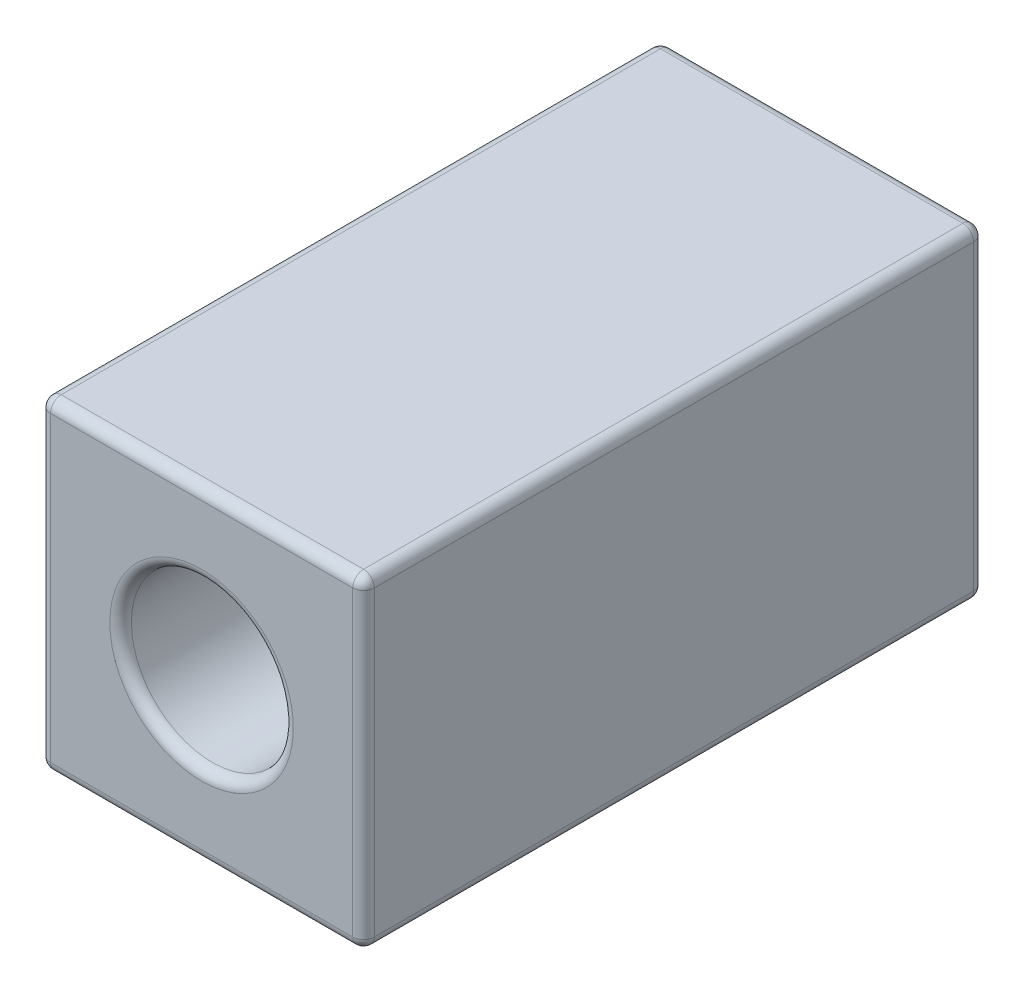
from build123d import *

# Parameters (mm, degrees)
ESQUISSE1_R      = 1.5
EXTRUSION1_DEPTH = 11.5
CONG_1_R         = 0.2


with BuildPart() as part:
    # Esquisse1 → Extrusion1 (new body)
    with BuildSketch(Plane.XY):
        with BuildLine():
            Line((-2.8, 3), (2.8, 3))
            ThreePointArc((2.8, 3), (2.941421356, 2.941421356), (3, 2.8))
            Line((3, 2.8), (3, -2.8))
            ThreePointArc((3, -2.8), (2.941421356, -2.941421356), (2.8, -3))
            Line((2.8, -3), (-2.8, -3))
            ThreePointArc((-2.8, -3), (-2.941421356, -2.941421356), (-3, -2.8))
            Line((-3, -2.8), (-3, 2.8))
            ThreePointArc((-3, 2.8), (-2.941421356, 2.941421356), (-2.8, 3))
        make_face()
        with Locations(Location((0, 0, 0), (0, 0, 180))):
            Circle(ESQUISSE1_R, mode=Mode.SUBTRACT)
    extrude(amount=EXTRUSION1_DEPTH)

    # Cong_1
    cong_1_edges = [part.edges().sort_by_distance(p)[0] for p in [
        (0, 3, 0),
        (0, 3, 11.5),
        (2.941421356, 2.941421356, 0),
        (2.941421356, 2.941421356, 11.5),
        (3, 0, 0),
        (3, 0, 11.5),
        (2.941421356, -2.941421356, 0),
        (2.941421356, -2.941421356, 11.5),
        (0, -3, 0),
        (0, -3, 11.5),
        (-2.941421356, -2.941421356, 0),
        (-2.941421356, -2.941421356, 11.5),
        (-3, 0, 0),
        (-3, 0, 11.5),
        (-2.941421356, 2.941421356, 0),
        (-2.941421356, 2.941421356, 11.5),
        (1.5, 0, 0),
        (1.5, 0, 11.5),
    ]]
    fillet(cong_1_edges, radius=CONG_1_R)


solid = part.part
